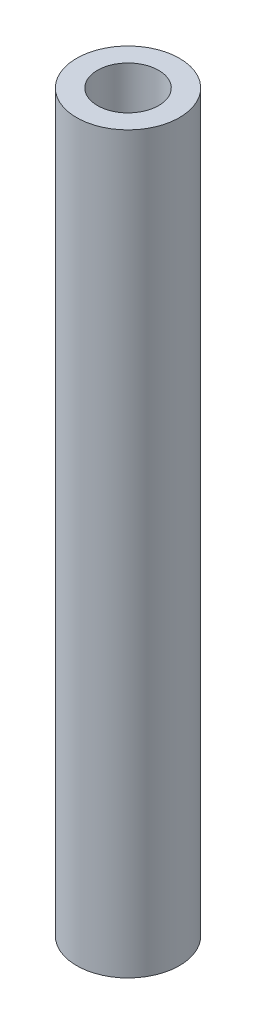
ISO-10303-21;
HEADER;
FILE_DESCRIPTION(('STEP AP214'),'2;1');
FILE_NAME('part.step','',(''),(''),'','','');
FILE_SCHEMA(('AUTOMOTIVE_DESIGN { 1 0 10303 214 1 1 1 1 }'));
ENDSEC;
DATA;
#1=APPLICATION_CONTEXT('core data for automotive mechanical design processes');
#2=APPLICATION_PROTOCOL_DEFINITION('international standard','automotive_design',2000,#1);
#3=PRODUCT_CONTEXT('',#1,'mechanical');
#4=PRODUCT('Part','Part','',(#3));
#5=PRODUCT_RELATED_PRODUCT_CATEGORY('part','',(#4));
#6=PRODUCT_DEFINITION_FORMATION('','',#4);
#7=PRODUCT_DEFINITION_CONTEXT('part definition',#1,'design');
#8=PRODUCT_DEFINITION('design','',#6,#7);
#9=PRODUCT_DEFINITION_SHAPE('','',#8);
#10=(LENGTH_UNIT() NAMED_UNIT(*) SI_UNIT(.MILLI.,.METRE.));
#11=(NAMED_UNIT(*) PLANE_ANGLE_UNIT() SI_UNIT($,.RADIAN.));
#12=(NAMED_UNIT(*) SI_UNIT($,.STERADIAN.) SOLID_ANGLE_UNIT());
#13=UNCERTAINTY_MEASURE_WITH_UNIT(LENGTH_MEASURE(1.E-05),#10,'distance_accuracy_value','');
#14=(GEOMETRIC_REPRESENTATION_CONTEXT(3) GLOBAL_UNCERTAINTY_ASSIGNED_CONTEXT((#13)) GLOBAL_UNIT_ASSIGNED_CONTEXT((#10,
#11,#12)) REPRESENTATION_CONTEXT('',''));
#15=CARTESIAN_POINT('',(0.,0.,0.));
#16=DIRECTION('',(0.,0.,1.));
#17=DIRECTION('',(1.,0.,0.));
#18=AXIS2_PLACEMENT_3D('',#15,#16,#17);
#19=CARTESIAN_POINT('',(0.,152.4,0.));
#20=DIRECTION('',(0.,1.,0.));
#21=DIRECTION('',(0.,0.,1.));
#22=AXIS2_PLACEMENT_3D('',#19,#20,#21);
#23=PLANE('',#22);
#24=CARTESIAN_POINT('',(0.,152.4,0.));
#25=DIRECTION('',(0.,1.,0.));
#26=DIRECTION('',(0.,0.,1.));
#27=AXIS2_PLACEMENT_3D('',#24,#25,#26);
#28=CIRCLE('',#27,10.668);
#29=CARTESIAN_POINT('',(0.,152.4,-10.668));
#30=VERTEX_POINT('',#29);
#31=EDGE_CURVE('E10',#30,#30,#28,.T.);
#32=ORIENTED_EDGE('',*,*,#31,.T.);
#33=EDGE_LOOP('',(#32));
#34=FACE_BOUND('',#33,.T.);
#35=CARTESIAN_POINT('',(0.,152.4,0.));
#36=DIRECTION('',(0.,1.,0.));
#37=DIRECTION('',(0.,0.,1.));
#38=AXIS2_PLACEMENT_3D('',#35,#36,#37);
#39=CIRCLE('',#38,6.35);
#40=CARTESIAN_POINT('',(0.,152.4,-6.35));
#41=VERTEX_POINT('',#40);
#42=EDGE_CURVE('E50',#41,#41,#39,.T.);
#43=ORIENTED_EDGE('',*,*,#42,.F.);
#44=EDGE_LOOP('',(#43));
#45=FACE_BOUND('',#44,.T.);
#46=ADVANCED_FACE('F37',(#34,#45),#23,.T.);
#47=CARTESIAN_POINT('',(0.,0.,0.));
#48=DIRECTION('',(0.,1.,0.));
#49=DIRECTION('',(0.,0.,1.));
#50=AXIS2_PLACEMENT_3D('',#47,#48,#49);
#51=PLANE('',#50);
#52=CARTESIAN_POINT('',(0.,0.,0.));
#53=DIRECTION('',(0.,1.,0.));
#54=DIRECTION('',(0.,0.,1.));
#55=AXIS2_PLACEMENT_3D('',#52,#53,#54);
#56=CIRCLE('',#55,10.668);
#57=CARTESIAN_POINT('',(0.,0.,-10.668));
#58=VERTEX_POINT('',#57);
#59=EDGE_CURVE('E41',#58,#58,#56,.T.);
#60=ORIENTED_EDGE('',*,*,#59,.F.);
#61=EDGE_LOOP('',(#60));
#62=FACE_BOUND('',#61,.T.);
#63=CARTESIAN_POINT('',(0.,0.,0.));
#64=DIRECTION('',(0.,1.,0.));
#65=DIRECTION('',(0.,0.,1.));
#66=AXIS2_PLACEMENT_3D('',#63,#64,#65);
#67=CIRCLE('',#66,6.35);
#68=CARTESIAN_POINT('',(0.,0.,-6.35));
#69=VERTEX_POINT('',#68);
#70=EDGE_CURVE('E52',#69,#69,#67,.T.);
#71=ORIENTED_EDGE('',*,*,#70,.T.);
#72=EDGE_LOOP('',(#71));
#73=FACE_BOUND('',#72,.T.);
#74=ADVANCED_FACE('F64',(#62,#73),#51,.F.);
#75=CARTESIAN_POINT('',(0.,152.4,0.));
#76=DIRECTION('',(0.,-1.,0.));
#77=DIRECTION('',(0.,0.,-1.));
#78=AXIS2_PLACEMENT_3D('',#75,#76,#77);
#79=CYLINDRICAL_SURFACE('',#78,10.668);
#80=CARTESIAN_POINT('',(0.,152.4,-10.668));
#81=CARTESIAN_POINT('',(0.,150.8125,-10.668));
#82=CARTESIAN_POINT('',(0.,149.225,-10.668));
#83=CARTESIAN_POINT('',(0.,146.05,-10.668));
#84=CARTESIAN_POINT('',(0.,144.4625,-10.668));
#85=CARTESIAN_POINT('',(0.,141.2875,-10.668));
#86=CARTESIAN_POINT('',(0.,139.7,-10.668));
#87=CARTESIAN_POINT('',(0.,136.525,-10.668));
#88=CARTESIAN_POINT('',(0.,134.9375,-10.668));
#89=CARTESIAN_POINT('',(0.,131.7625,-10.668));
#90=CARTESIAN_POINT('',(0.,130.175,-10.668));
#91=CARTESIAN_POINT('',(0.,127.,-10.668));
#92=CARTESIAN_POINT('',(0.,125.4125,-10.668));
#93=CARTESIAN_POINT('',(0.,122.2375,-10.668));
#94=CARTESIAN_POINT('',(0.,120.65,-10.668));
#95=CARTESIAN_POINT('',(0.,117.475,-10.668));
#96=CARTESIAN_POINT('',(0.,115.8875,-10.668));
#97=CARTESIAN_POINT('',(0.,112.7125,-10.668));
#98=CARTESIAN_POINT('',(0.,111.125,-10.668));
#99=CARTESIAN_POINT('',(0.,107.95,-10.668));
#100=CARTESIAN_POINT('',(0.,106.3625,-10.668));
#101=CARTESIAN_POINT('',(0.,103.1875,-10.668));
#102=CARTESIAN_POINT('',(0.,101.6,-10.668));
#103=CARTESIAN_POINT('',(0.,98.425,-10.668));
#104=CARTESIAN_POINT('',(0.,96.8375,-10.668));
#105=CARTESIAN_POINT('',(0.,93.6625,-10.668));
#106=CARTESIAN_POINT('',(0.,92.075,-10.668));
#107=CARTESIAN_POINT('',(0.,88.9,-10.668));
#108=CARTESIAN_POINT('',(0.,87.3125,-10.668));
#109=CARTESIAN_POINT('',(0.,84.1375,-10.668));
#110=CARTESIAN_POINT('',(0.,82.55,-10.668));
#111=CARTESIAN_POINT('',(0.,79.375,-10.668));
#112=CARTESIAN_POINT('',(0.,77.7875,-10.668));
#113=CARTESIAN_POINT('',(0.,74.6125,-10.668));
#114=CARTESIAN_POINT('',(0.,73.025,-10.668));
#115=CARTESIAN_POINT('',(0.,69.85,-10.668));
#116=CARTESIAN_POINT('',(0.,68.2625,-10.668));
#117=CARTESIAN_POINT('',(0.,65.0875,-10.668));
#118=CARTESIAN_POINT('',(0.,63.5,-10.668));
#119=CARTESIAN_POINT('',(0.,60.325,-10.668));
#120=CARTESIAN_POINT('',(0.,58.7375,-10.668));
#121=CARTESIAN_POINT('',(0.,55.5625,-10.668));
#122=CARTESIAN_POINT('',(0.,53.975,-10.668));
#123=CARTESIAN_POINT('',(0.,50.8,-10.668));
#124=CARTESIAN_POINT('',(0.,49.2125,-10.668));
#125=CARTESIAN_POINT('',(0.,46.0375,-10.668));
#126=CARTESIAN_POINT('',(0.,44.45,-10.668));
#127=CARTESIAN_POINT('',(0.,41.275,-10.668));
#128=CARTESIAN_POINT('',(0.,39.6875,-10.668));
#129=CARTESIAN_POINT('',(0.,36.5125,-10.668));
#130=CARTESIAN_POINT('',(0.,34.925,-10.668));
#131=CARTESIAN_POINT('',(0.,31.75,-10.668));
#132=CARTESIAN_POINT('',(0.,30.1625,-10.668));
#133=CARTESIAN_POINT('',(0.,26.9875,-10.668));
#134=CARTESIAN_POINT('',(0.,25.4,-10.668));
#135=CARTESIAN_POINT('',(0.,22.225,-10.668));
#136=CARTESIAN_POINT('',(0.,20.6375,-10.668));
#137=CARTESIAN_POINT('',(0.,17.4625,-10.668));
#138=CARTESIAN_POINT('',(0.,15.875,-10.668));
#139=CARTESIAN_POINT('',(0.,12.7,-10.668));
#140=CARTESIAN_POINT('',(0.,11.1125,-10.668));
#141=CARTESIAN_POINT('',(0.,7.93750000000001,-10.668));
#142=CARTESIAN_POINT('',(0.,6.35,-10.668));
#143=CARTESIAN_POINT('',(0.,3.175,-10.668));
#144=CARTESIAN_POINT('',(0.,1.5875,-10.668));
#145=CARTESIAN_POINT('',(0.,0.,-10.668));
#146=B_SPLINE_CURVE_WITH_KNOTS('',3,(#80,#81,#82,#83,#84,#85,#86,#87,#88,#89,#90,#91,#92,#93,
#94,#95,#96,#97,#98,#99,#100,#101,#102,#103,#104,#105,#106,#107,#108,#109,#110,#111,#112,#113,
#114,#115,#116,#117,#118,#119,#120,#121,#122,#123,#124,#125,#126,#127,#128,#129,#130,#131,#132,
#133,#134,#135,#136,#137,#138,#139,#140,#141,#142,#143,#144,#145),.UNSPECIFIED.,.F.,.F.,(4,2,2,
2,2,2,2,2,2,2,2,2,2,2,2,2,2,2,2,2,2,2,2,2,2,2,2,2,2,2,2,2,4),(0.,4.76249999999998,
9.52499999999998,14.2875,19.05,23.8125,28.575,33.3375,38.1,42.8625,47.625,52.3875,57.15,61.9125,
66.675,71.4375,76.2,80.9625,85.725,90.4875,95.25,100.0125,104.775,109.5375,114.3,119.0625,
123.825,128.5875,133.35,138.1125,142.875,147.6375,152.4),.UNSPECIFIED.);
#147=EDGE_CURVE('BSEAM39',#30,#58,#146,.T.);
#148=ORIENTED_EDGE('',*,*,#31,.F.);
#149=ORIENTED_EDGE('',*,*,#59,.T.);
#150=ORIENTED_EDGE('',*,*,#147,.T.);
#151=ORIENTED_EDGE('',*,*,#147,.F.);
#152=EDGE_LOOP('',(#148,#150,#149,#151));
#153=FACE_BOUND('',#152,.T.);
#154=ADVANCED_FACE('F39',(#153),#79,.T.);
#155=CARTESIAN_POINT('',(0.,152.4,0.));
#156=DIRECTION('',(0.,-1.,0.));
#157=DIRECTION('',(0.,0.,-1.));
#158=AXIS2_PLACEMENT_3D('',#155,#156,#157);
#159=CYLINDRICAL_SURFACE('',#158,6.35);
#160=CARTESIAN_POINT('',(0.,152.4,-6.35));
#161=CARTESIAN_POINT('',(0.,150.8125,-6.35));
#162=CARTESIAN_POINT('',(0.,149.225,-6.35));
#163=CARTESIAN_POINT('',(0.,146.05,-6.35));
#164=CARTESIAN_POINT('',(0.,144.4625,-6.35));
#165=CARTESIAN_POINT('',(0.,141.2875,-6.35));
#166=CARTESIAN_POINT('',(0.,139.7,-6.35));
#167=CARTESIAN_POINT('',(0.,136.525,-6.35));
#168=CARTESIAN_POINT('',(0.,134.9375,-6.35));
#169=CARTESIAN_POINT('',(0.,131.7625,-6.35));
#170=CARTESIAN_POINT('',(0.,130.175,-6.35));
#171=CARTESIAN_POINT('',(0.,127.,-6.35));
#172=CARTESIAN_POINT('',(0.,125.4125,-6.35));
#173=CARTESIAN_POINT('',(0.,122.2375,-6.35));
#174=CARTESIAN_POINT('',(0.,120.65,-6.35));
#175=CARTESIAN_POINT('',(0.,117.475,-6.35));
#176=CARTESIAN_POINT('',(0.,115.8875,-6.35));
#177=CARTESIAN_POINT('',(0.,112.7125,-6.35));
#178=CARTESIAN_POINT('',(0.,111.125,-6.35));
#179=CARTESIAN_POINT('',(0.,107.95,-6.35));
#180=CARTESIAN_POINT('',(0.,106.3625,-6.35));
#181=CARTESIAN_POINT('',(0.,103.1875,-6.35));
#182=CARTESIAN_POINT('',(0.,101.6,-6.35));
#183=CARTESIAN_POINT('',(0.,98.425,-6.35));
#184=CARTESIAN_POINT('',(0.,96.8375,-6.35));
#185=CARTESIAN_POINT('',(0.,93.6625,-6.35));
#186=CARTESIAN_POINT('',(0.,92.075,-6.35));
#187=CARTESIAN_POINT('',(0.,88.9,-6.35));
#188=CARTESIAN_POINT('',(0.,87.3125,-6.35));
#189=CARTESIAN_POINT('',(0.,84.1375,-6.35));
#190=CARTESIAN_POINT('',(0.,82.55,-6.35));
#191=CARTESIAN_POINT('',(0.,79.375,-6.35));
#192=CARTESIAN_POINT('',(0.,77.7875,-6.35));
#193=CARTESIAN_POINT('',(0.,74.6125,-6.35));
#194=CARTESIAN_POINT('',(0.,73.025,-6.35));
#195=CARTESIAN_POINT('',(0.,69.85,-6.35));
#196=CARTESIAN_POINT('',(0.,68.2625,-6.35));
#197=CARTESIAN_POINT('',(0.,65.0875,-6.35));
#198=CARTESIAN_POINT('',(0.,63.5,-6.35));
#199=CARTESIAN_POINT('',(0.,60.325,-6.35));
#200=CARTESIAN_POINT('',(0.,58.7375,-6.35));
#201=CARTESIAN_POINT('',(0.,55.5625,-6.35));
#202=CARTESIAN_POINT('',(0.,53.975,-6.35));
#203=CARTESIAN_POINT('',(0.,50.8,-6.35));
#204=CARTESIAN_POINT('',(0.,49.2125,-6.35));
#205=CARTESIAN_POINT('',(0.,46.0375,-6.35));
#206=CARTESIAN_POINT('',(0.,44.45,-6.35));
#207=CARTESIAN_POINT('',(0.,41.275,-6.35));
#208=CARTESIAN_POINT('',(0.,39.6875,-6.35));
#209=CARTESIAN_POINT('',(0.,36.5125,-6.35));
#210=CARTESIAN_POINT('',(0.,34.925,-6.35));
#211=CARTESIAN_POINT('',(0.,31.75,-6.35));
#212=CARTESIAN_POINT('',(0.,30.1625,-6.35));
#213=CARTESIAN_POINT('',(0.,26.9875,-6.35));
#214=CARTESIAN_POINT('',(0.,25.4,-6.35));
#215=CARTESIAN_POINT('',(0.,22.225,-6.35));
#216=CARTESIAN_POINT('',(0.,20.6375,-6.35));
#217=CARTESIAN_POINT('',(0.,17.4625,-6.35));
#218=CARTESIAN_POINT('',(0.,15.875,-6.35));
#219=CARTESIAN_POINT('',(0.,12.7,-6.35));
#220=CARTESIAN_POINT('',(0.,11.1125,-6.35));
#221=CARTESIAN_POINT('',(0.,7.93750000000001,-6.35));
#222=CARTESIAN_POINT('',(0.,6.35,-6.35));
#223=CARTESIAN_POINT('',(0.,3.175,-6.35));
#224=CARTESIAN_POINT('',(0.,1.5875,-6.35));
#225=CARTESIAN_POINT('',(0.,0.,-6.35));
#226=B_SPLINE_CURVE_WITH_KNOTS('',3,(#160,#161,#162,#163,#164,#165,#166,#167,#168,#169,#170,
#171,#172,#173,#174,#175,#176,#177,#178,#179,#180,#181,#182,#183,#184,#185,#186,#187,#188,#189,
#190,#191,#192,#193,#194,#195,#196,#197,#198,#199,#200,#201,#202,#203,#204,#205,#206,#207,#208,
#209,#210,#211,#212,#213,#214,#215,#216,#217,#218,#219,#220,#221,#222,#223,#224,#225),
.UNSPECIFIED.,.F.,.F.,(4,2,2,2,2,2,2,2,2,2,2,2,2,2,2,2,2,2,2,2,2,2,2,2,2,2,2,2,2,2,2,2,4),(0.,
4.7625,9.52500000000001,14.2875,19.05,23.8125,28.575,33.3375,38.1,42.8625,47.625,52.3875,57.15,
61.9125,66.675,71.4375,76.2,80.9625,85.725,90.4875,95.25,100.0125,104.775,109.5375,114.3,
119.0625,123.825,128.5875,133.35,138.1125,142.875,147.6375,152.4),.UNSPECIFIED.);
#227=EDGE_CURVE('BSEAM60',#41,#69,#226,.T.);
#228=ORIENTED_EDGE('',*,*,#42,.T.);
#229=ORIENTED_EDGE('',*,*,#70,.F.);
#230=ORIENTED_EDGE('',*,*,#227,.T.);
#231=ORIENTED_EDGE('',*,*,#227,.F.);
#232=EDGE_LOOP('',(#228,#230,#229,#231));
#233=FACE_BOUND('',#232,.T.);
#234=ADVANCED_FACE('F60',(#233),#159,.F.);
#235=CLOSED_SHELL('',(#46,#74,#154,#234));
#236=MANIFOLD_SOLID_BREP('B2',#235);
#237=ADVANCED_BREP_SHAPE_REPRESENTATION('',(#18,#236),#14);
#238=SHAPE_DEFINITION_REPRESENTATION(#9,#237);
ENDSEC;
END-ISO-10303-21;
